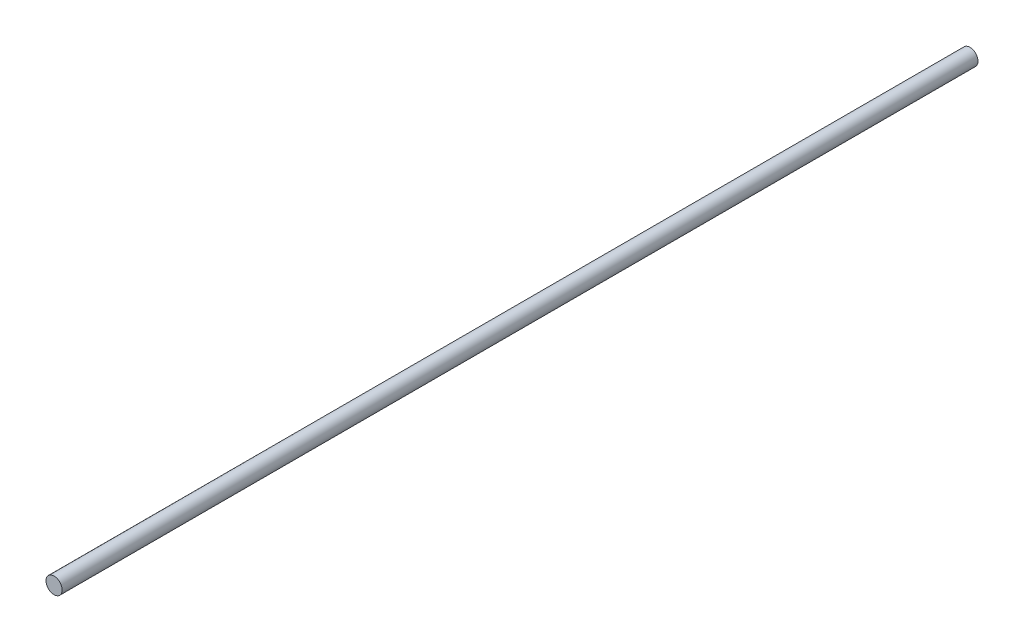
from build123d import *

# Parameters (mm, degrees)
ESQUISSE1_R        = 3
BOSS_EXTRU_1_DEPTH = 340


with BuildPart() as part:
    # Esquisse1 → Boss.-Extru.1 (new body)
    with BuildSketch(Plane.XY):
        Circle(ESQUISSE1_R)
    extrude(amount=BOSS_EXTRU_1_DEPTH)


solid = part.part
